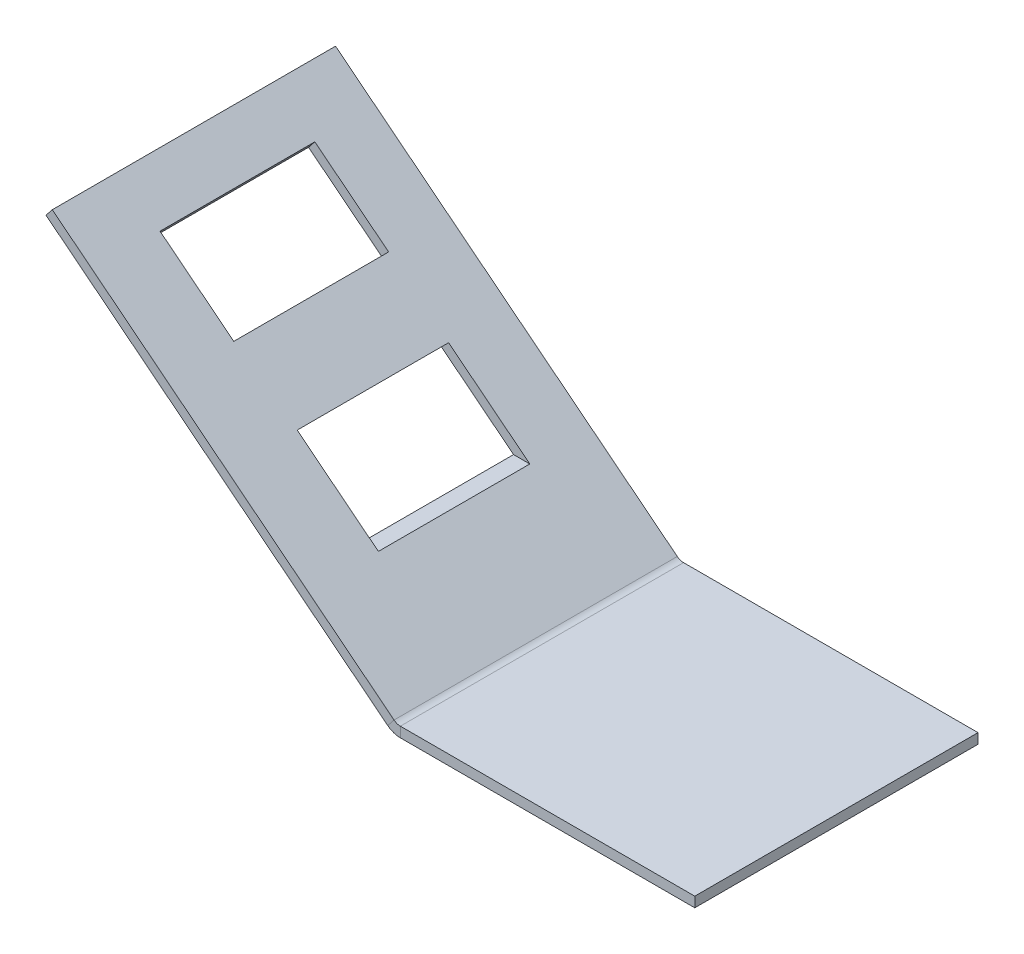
ISO-10303-21;
HEADER;
FILE_DESCRIPTION(('STEP AP214'),'2;1');
FILE_NAME('part.step','',(''),(''),'','','');
FILE_SCHEMA(('AUTOMOTIVE_DESIGN { 1 0 10303 214 1 1 1 1 }'));
ENDSEC;
DATA;
#1=APPLICATION_CONTEXT('core data for automotive mechanical design processes');
#2=APPLICATION_PROTOCOL_DEFINITION('international standard','automotive_design',2000,#1);
#3=PRODUCT_CONTEXT('',#1,'mechanical');
#4=PRODUCT('Part','Part','',(#3));
#5=PRODUCT_RELATED_PRODUCT_CATEGORY('part','',(#4));
#6=PRODUCT_DEFINITION_FORMATION('','',#4);
#7=PRODUCT_DEFINITION_CONTEXT('part definition',#1,'design');
#8=PRODUCT_DEFINITION('design','',#6,#7);
#9=PRODUCT_DEFINITION_SHAPE('','',#8);
#10=(LENGTH_UNIT() NAMED_UNIT(*) SI_UNIT(.MILLI.,.METRE.));
#11=(NAMED_UNIT(*) PLANE_ANGLE_UNIT() SI_UNIT($,.RADIAN.));
#12=(NAMED_UNIT(*) SI_UNIT($,.STERADIAN.) SOLID_ANGLE_UNIT());
#13=UNCERTAINTY_MEASURE_WITH_UNIT(LENGTH_MEASURE(1.E-05),#10,'distance_accuracy_value','');
#14=(GEOMETRIC_REPRESENTATION_CONTEXT(3) GLOBAL_UNCERTAINTY_ASSIGNED_CONTEXT((#13)) GLOBAL_UNIT_ASSIGNED_CONTEXT((#10,
#11,#12)) REPRESENTATION_CONTEXT('',''));
#15=CARTESIAN_POINT('',(0.,0.,0.));
#16=DIRECTION('',(0.,0.,1.));
#17=DIRECTION('',(1.,0.,0.));
#18=AXIS2_PLACEMENT_3D('',#15,#16,#17);
#19=CARTESIAN_POINT('',(-68.1183407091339,54.0258064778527,28.));
#20=DIRECTION('',(0.621401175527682,0.783492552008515,0.));
#21=DIRECTION('',(-0.783492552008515,0.621401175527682,0.));
#22=AXIS2_PLACEMENT_3D('',#19,#20,#21);
#23=PLANE('',#22);
#24=DIRECTION('',(0.783492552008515,-0.621401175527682,0.));
#25=VECTOR('',#24,1.);
#26=CARTESIAN_POINT('',(-68.1183407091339,54.0258064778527,14.1326879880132));
#27=LINE('',#26,#25);
#28=CARTESIAN_POINT('',(-33.5678578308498,26.6232349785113,14.1326879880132));
#29=VERTEX_POINT('',#28);
#30=CARTESIAN_POINT('',(-17.5094716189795,13.8870576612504,14.1326879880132));
#31=VERTEX_POINT('',#30);
#32=EDGE_CURVE('E156',#29,#31,#27,.T.);
#33=ORIENTED_EDGE('',*,*,#32,.F.);
#34=DIRECTION('',(0.,0.,1.));
#35=VECTOR('',#34,1.);
#36=CARTESIAN_POINT('',(-33.5678578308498,26.6232349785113,28.));
#37=LINE('',#36,#35);
#38=CARTESIAN_POINT('',(-33.5678578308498,26.6232349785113,-15.808500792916));
#39=VERTEX_POINT('',#38);
#40=EDGE_CURVE('E274',#39,#29,#37,.T.);
#41=ORIENTED_EDGE('',*,*,#40,.F.);
#42=DIRECTION('',(-0.783492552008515,0.621401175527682,0.));
#43=VECTOR('',#42,1.);
#44=CARTESIAN_POINT('',(-68.1183407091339,54.0258064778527,-15.808500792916));
#45=LINE('',#44,#43);
#46=CARTESIAN_POINT('',(-17.5094716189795,13.8870576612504,-15.808500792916));
#47=VERTEX_POINT('',#46);
#48=EDGE_CURVE('E276',#47,#39,#45,.T.);
#49=ORIENTED_EDGE('',*,*,#48,.F.);
#50=DIRECTION('',(0.,0.,-1.));
#51=VECTOR('',#50,1.);
#52=CARTESIAN_POINT('',(-17.5094716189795,13.8870576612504,28.));
#53=LINE('',#52,#51);
#54=EDGE_CURVE('E278',#31,#47,#53,.T.);
#55=ORIENTED_EDGE('',*,*,#54,.F.);
#56=EDGE_LOOP('',(#33,#41,#49,#55));
#57=FACE_BOUND('',#56,.T.);
#58=DIRECTION('',(0.783492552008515,-0.621401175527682,0.));
#59=VECTOR('',#58,1.);
#60=CARTESIAN_POINT('',(-68.1183407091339,54.0258064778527,-28.));
#61=LINE('',#60,#59);
#62=CARTESIAN_POINT('',(-68.1183407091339,54.0258064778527,-28.));
#63=VERTEX_POINT('',#62);
#64=CARTESIAN_POINT('',(-0.545966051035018,0.433014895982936,-28.));
#65=VERTEX_POINT('',#64);
#66=EDGE_CURVE('E226',#63,#65,#61,.T.);
#67=ORIENTED_EDGE('',*,*,#66,.F.);
#68=DIRECTION('',(0.,0.,-1.));
#69=VECTOR('',#68,1.);
#70=CARTESIAN_POINT('',(-68.1183407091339,54.0258064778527,28.));
#71=LINE('',#70,#69);
#72=CARTESIAN_POINT('',(-68.1183407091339,54.0258064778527,28.));
#73=VERTEX_POINT('',#72);
#74=EDGE_CURVE('E184',#73,#63,#71,.T.);
#75=ORIENTED_EDGE('',*,*,#74,.F.);
#76=DIRECTION('',(0.783492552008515,-0.621401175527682,0.));
#77=VECTOR('',#76,1.);
#78=CARTESIAN_POINT('',(-68.1183407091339,54.0258064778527,28.));
#79=LINE('',#78,#77);
#80=CARTESIAN_POINT('',(-0.545966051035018,0.433014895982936,28.));
#81=VERTEX_POINT('',#80);
#82=EDGE_CURVE('E203',#73,#81,#79,.T.);
#83=ORIENTED_EDGE('',*,*,#82,.T.);
#84=DIRECTION('',(0.,0.,-1.));
#85=VECTOR('',#84,1.);
#86=CARTESIAN_POINT('',(-0.545966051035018,0.433014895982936,28.));
#87=LINE('',#86,#85);
#88=EDGE_CURVE('E181',#81,#65,#87,.T.);
#89=ORIENTED_EDGE('',*,*,#88,.T.);
#90=EDGE_LOOP('',(#67,#75,#83,#89));
#91=FACE_BOUND('',#90,.T.);
#92=DIRECTION('',(-0.783492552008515,0.621401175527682,0.));
#93=VECTOR('',#92,1.);
#94=CARTESIAN_POINT('',(-68.1183407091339,54.0258064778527,-15.9202216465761));
#95=LINE('',#94,#93);
#96=CARTESIAN_POINT('',(-45.5412159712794,36.1195075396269,-15.9202216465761));
#97=VERTEX_POINT('',#96);
#98=CARTESIAN_POINT('',(-60.1254282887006,47.686492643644,-15.9202216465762));
#99=VERTEX_POINT('',#98);
#100=EDGE_CURVE('E252',#97,#99,#95,.T.);
#101=ORIENTED_EDGE('',*,*,#100,.F.);
#102=DIRECTION('',(0.,0.,-1.));
#103=VECTOR('',#102,1.);
#104=CARTESIAN_POINT('',(-45.5412159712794,36.1195075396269,28.));
#105=LINE('',#104,#103);
#106=CARTESIAN_POINT('',(-45.5412159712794,36.1195075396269,14.6912922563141));
#107=VERTEX_POINT('',#106);
#108=EDGE_CURVE('E259',#107,#97,#105,.T.);
#109=ORIENTED_EDGE('',*,*,#108,.F.);
#110=DIRECTION('',(0.783492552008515,-0.621401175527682,0.));
#111=VECTOR('',#110,1.);
#112=CARTESIAN_POINT('',(-68.1183407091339,54.0258064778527,14.6912922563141));
#113=LINE('',#112,#111);
#114=CARTESIAN_POINT('',(-60.1254282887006,47.686492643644,14.6912922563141));
#115=VERTEX_POINT('',#114);
#116=EDGE_CURVE('E261',#115,#107,#113,.T.);
#117=ORIENTED_EDGE('',*,*,#116,.F.);
#118=DIRECTION('',(0.,0.,1.));
#119=VECTOR('',#118,1.);
#120=CARTESIAN_POINT('',(-60.1254282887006,47.686492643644,28.));
#121=LINE('',#120,#119);
#122=EDGE_CURVE('E267',#99,#115,#121,.T.);
#123=ORIENTED_EDGE('',*,*,#122,.F.);
#124=EDGE_LOOP('',(#101,#109,#117,#123));
#125=FACE_BOUND('',#124,.T.);
#126=ADVANCED_FACE('F34',(#57,#91,#125),#23,.T.);
#127=CARTESIAN_POINT('',(-69.3611430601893,52.4588213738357,28.));
#128=DIRECTION('',(0.621401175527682,0.783492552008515,0.));
#129=DIRECTION('',(-0.783492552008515,0.621401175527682,0.));
#130=AXIS2_PLACEMENT_3D('',#127,#128,#129);
#131=PLANE('',#130);
#132=DIRECTION('',(0.,0.,1.));
#133=VECTOR('',#132,1.);
#134=CARTESIAN_POINT('',(-36.7863905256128,26.6232349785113,28.));
#135=LINE('',#134,#133);
#136=CARTESIAN_POINT('',(-36.7863905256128,26.6232349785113,-15.808500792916));
#137=VERTEX_POINT('',#136);
#138=CARTESIAN_POINT('',(-36.7863905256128,26.6232349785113,14.1326879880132));
#139=VERTEX_POINT('',#138);
#140=EDGE_CURVE('E42',#137,#139,#135,.T.);
#141=ORIENTED_EDGE('',*,*,#140,.T.);
#142=DIRECTION('',(0.783492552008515,-0.621401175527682,0.));
#143=VECTOR('',#142,1.);
#144=CARTESIAN_POINT('',(-69.3611430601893,52.4588213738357,14.1326879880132));
#145=LINE('',#144,#143);
#146=CARTESIAN_POINT('',(-20.7280043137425,13.8870576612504,14.1326879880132));
#147=VERTEX_POINT('',#146);
#148=EDGE_CURVE('E11',#139,#147,#145,.T.);
#149=ORIENTED_EDGE('',*,*,#148,.T.);
#150=DIRECTION('',(0.,0.,-1.));
#151=VECTOR('',#150,1.);
#152=CARTESIAN_POINT('',(-20.7280043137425,13.8870576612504,28.));
#153=LINE('',#152,#151);
#154=CARTESIAN_POINT('',(-20.7280043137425,13.8870576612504,-15.808500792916));
#155=VERTEX_POINT('',#154);
#156=EDGE_CURVE('E144',#147,#155,#153,.T.);
#157=ORIENTED_EDGE('',*,*,#156,.T.);
#158=DIRECTION('',(-0.783492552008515,0.621401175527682,0.));
#159=VECTOR('',#158,1.);
#160=CARTESIAN_POINT('',(-69.3611430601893,52.4588213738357,-15.808500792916));
#161=LINE('',#160,#159);
#162=EDGE_CURVE('E148',#155,#137,#161,.T.);
#163=ORIENTED_EDGE('',*,*,#162,.T.);
#164=EDGE_LOOP('',(#141,#149,#157,#163));
#165=FACE_BOUND('',#164,.T.);
#166=DIRECTION('',(0.783492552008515,-0.621401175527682,0.));
#167=VECTOR('',#166,1.);
#168=CARTESIAN_POINT('',(-69.3611430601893,52.4588213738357,-28.));
#169=LINE('',#168,#167);
#170=CARTESIAN_POINT('',(-69.3611430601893,52.4588213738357,-28.));
#171=VERTEX_POINT('',#170);
#172=CARTESIAN_POINT('',(-1.78876840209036,-1.13397020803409,-28.));
#173=VERTEX_POINT('',#172);
#174=EDGE_CURVE('E220',#171,#173,#169,.T.);
#175=ORIENTED_EDGE('',*,*,#174,.T.);
#176=DIRECTION('',(0.,0.,-1.));
#177=VECTOR('',#176,1.);
#178=CARTESIAN_POINT('',(-1.78876840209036,-1.13397020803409,28.));
#179=LINE('',#178,#177);
#180=CARTESIAN_POINT('',(-1.78876840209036,-1.13397020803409,28.));
#181=VERTEX_POINT('',#180);
#182=EDGE_CURVE('E188',#181,#173,#179,.T.);
#183=ORIENTED_EDGE('',*,*,#182,.F.);
#184=DIRECTION('',(0.783492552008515,-0.621401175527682,0.));
#185=VECTOR('',#184,1.);
#186=CARTESIAN_POINT('',(-69.3611430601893,52.4588213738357,28.));
#187=LINE('',#186,#185);
#188=CARTESIAN_POINT('',(-69.3611430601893,52.4588213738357,28.));
#189=VERTEX_POINT('',#188);
#190=EDGE_CURVE('E197',#189,#181,#187,.T.);
#191=ORIENTED_EDGE('',*,*,#190,.F.);
#192=DIRECTION('',(0.,0.,-1.));
#193=VECTOR('',#192,1.);
#194=CARTESIAN_POINT('',(-69.3611430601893,52.4588213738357,28.));
#195=LINE('',#194,#193);
#196=EDGE_CURVE('E186',#189,#171,#195,.T.);
#197=ORIENTED_EDGE('',*,*,#196,.T.);
#198=EDGE_LOOP('',(#175,#183,#191,#197));
#199=FACE_BOUND('',#198,.T.);
#200=DIRECTION('',(0.,0.,1.));
#201=VECTOR('',#200,1.);
#202=CARTESIAN_POINT('',(-46.7840183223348,34.5525224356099,28.));
#203=LINE('',#202,#201);
#204=CARTESIAN_POINT('',(-46.7840183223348,34.5525224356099,14.6912922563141));
#205=VERTEX_POINT('',#204);
#206=CARTESIAN_POINT('',(-46.7840183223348,34.5525224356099,-15.9202216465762));
#207=VERTEX_POINT('',#206);
#208=EDGE_CURVE('E251',#205,#207,#203,.F.);
#209=ORIENTED_EDGE('',*,*,#208,.T.);
#210=DIRECTION('',(-0.783492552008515,0.621401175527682,0.));
#211=VECTOR('',#210,1.);
#212=CARTESIAN_POINT('',(-69.3611430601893,52.4588213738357,-15.9202216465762));
#213=LINE('',#212,#211);
#214=CARTESIAN_POINT('',(-61.3682306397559,46.1195075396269,-15.9202216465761));
#215=VERTEX_POINT('',#214);
#216=EDGE_CURVE('E247',#207,#215,#213,.T.);
#217=ORIENTED_EDGE('',*,*,#216,.T.);
#218=DIRECTION('',(0.,0.,1.));
#219=VECTOR('',#218,1.);
#220=CARTESIAN_POINT('',(-61.3682306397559,46.1195075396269,28.));
#221=LINE('',#220,#219);
#222=CARTESIAN_POINT('',(-61.3682306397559,46.1195075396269,14.6912922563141));
#223=VERTEX_POINT('',#222);
#224=EDGE_CURVE('E270',#215,#223,#221,.T.);
#225=ORIENTED_EDGE('',*,*,#224,.T.);
#226=DIRECTION('',(-0.783492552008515,0.621401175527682,0.));
#227=VECTOR('',#226,1.);
#228=CARTESIAN_POINT('',(-69.3611430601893,52.4588213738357,14.6912922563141));
#229=LINE('',#228,#227);
#230=EDGE_CURVE('E248',#223,#205,#229,.F.);
#231=ORIENTED_EDGE('',*,*,#230,.T.);
#232=EDGE_LOOP('',(#209,#217,#225,#231));
#233=FACE_BOUND('',#232,.T.);
#234=ADVANCED_FACE('F160',(#165,#199,#233),#131,.F.);
#235=CARTESIAN_POINT('',(0.69683630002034,0.,28.));
#236=DIRECTION('',(0.,0.,1.));
#237=DIRECTION('',(1.,0.,0.));
#238=AXIS2_PLACEMENT_3D('',#235,#236,#237);
#239=PLANE('',#238);
#240=DIRECTION('',(0.,-1.,0.));
#241=VECTOR('',#240,1.);
#242=CARTESIAN_POINT('',(0.69683630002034,0.,28.));
#243=LINE('',#242,#241);
#244=CARTESIAN_POINT('',(0.69683630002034,0.,28.));
#245=VERTEX_POINT('',#244);
#246=CARTESIAN_POINT('',(0.69683630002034,-2.,28.));
#247=VERTEX_POINT('',#246);
#248=EDGE_CURVE('E149',#245,#247,#243,.T.);
#249=ORIENTED_EDGE('',*,*,#248,.F.);
#250=CARTESIAN_POINT('',(0.69683630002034,1.99999999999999,28.));
#251=DIRECTION('',(0.,0.,-1.));
#252=DIRECTION('',(-1.,0.,0.));
#253=AXIS2_PLACEMENT_3D('',#250,#251,#252);
#254=CIRCLE('',#253,2.);
#255=EDGE_CURVE('E206',#81,#245,#254,.F.);
#256=ORIENTED_EDGE('',*,*,#255,.F.);
#257=DIRECTION('',(0.621401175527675,0.78349255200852,0.));
#258=VECTOR('',#257,1.);
#259=CARTESIAN_POINT('',(-1.78876840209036,-1.13397020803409,28.));
#260=LINE('',#259,#258);
#261=EDGE_CURVE('E168',#181,#81,#260,.T.);
#262=ORIENTED_EDGE('',*,*,#261,.F.);
#263=CARTESIAN_POINT('',(0.69683630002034,1.99999999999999,28.));
#264=DIRECTION('',(0.,0.,1.));
#265=DIRECTION('',(1.,0.,0.));
#266=AXIS2_PLACEMENT_3D('',#263,#264,#265);
#267=CIRCLE('',#266,4.);
#268=EDGE_CURVE('E194',#181,#247,#267,.T.);
#269=ORIENTED_EDGE('',*,*,#268,.T.);
#270=EDGE_LOOP('',(#249,#256,#262,#269));
#271=FACE_BOUND('',#270,.T.);
#272=ADVANCED_FACE('F36',(#271),#239,.T.);
#273=CARTESIAN_POINT('',(-1.78876840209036,-1.13397020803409,28.));
#274=DIRECTION('',(0.,0.,1.));
#275=DIRECTION('',(1.,0.,0.));
#276=AXIS2_PLACEMENT_3D('',#273,#274,#275);
#277=PLANE('',#276);
#278=DIRECTION('',(1.,0.,0.));
#279=VECTOR('',#278,1.);
#280=CARTESIAN_POINT('',(0.,0.,28.));
#281=LINE('',#280,#279);
#282=CARTESIAN_POINT('',(58.9096385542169,0.,28.));
#283=VERTEX_POINT('',#282);
#284=EDGE_CURVE('E209',#245,#283,#281,.T.);
#285=ORIENTED_EDGE('',*,*,#284,.F.);
#286=ORIENTED_EDGE('',*,*,#248,.T.);
#287=DIRECTION('',(1.,0.,0.));
#288=VECTOR('',#287,1.);
#289=CARTESIAN_POINT('',(0.,-2.,28.));
#290=LINE('',#289,#288);
#291=CARTESIAN_POINT('',(58.9096385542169,-2.,28.));
#292=VERTEX_POINT('',#291);
#293=EDGE_CURVE('E215',#247,#292,#290,.T.);
#294=ORIENTED_EDGE('',*,*,#293,.T.);
#295=DIRECTION('',(0.,-1.,0.));
#296=VECTOR('',#295,1.);
#297=CARTESIAN_POINT('',(58.9096385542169,0.,28.));
#298=LINE('',#297,#296);
#299=EDGE_CURVE('E212',#283,#292,#298,.T.);
#300=ORIENTED_EDGE('',*,*,#299,.F.);
#301=EDGE_LOOP('',(#285,#286,#294,#300));
#302=FACE_BOUND('',#301,.T.);
#303=ADVANCED_FACE('F331',(#302),#277,.T.);
#304=CARTESIAN_POINT('',(-0.545966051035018,0.433014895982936,-28.));
#305=DIRECTION('',(0.,0.,-1.));
#306=DIRECTION('',(-1.,0.,0.));
#307=AXIS2_PLACEMENT_3D('',#304,#305,#306);
#308=PLANE('',#307);
#309=DIRECTION('',(-0.621401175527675,-0.78349255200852,0.));
#310=VECTOR('',#309,1.);
#311=CARTESIAN_POINT('',(-0.545966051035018,0.433014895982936,-28.));
#312=LINE('',#311,#310);
#313=EDGE_CURVE('E170',#65,#173,#312,.T.);
#314=ORIENTED_EDGE('',*,*,#313,.F.);
#315=CARTESIAN_POINT('',(0.69683630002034,1.99999999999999,-28.));
#316=DIRECTION('',(0.,0.,-1.));
#317=DIRECTION('',(-1.,0.,0.));
#318=AXIS2_PLACEMENT_3D('',#315,#316,#317);
#319=CIRCLE('',#318,2.);
#320=CARTESIAN_POINT('',(0.69683630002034,0.,-28.));
#321=VERTEX_POINT('',#320);
#322=EDGE_CURVE('E229',#65,#321,#319,.F.);
#323=ORIENTED_EDGE('',*,*,#322,.T.);
#324=DIRECTION('',(0.,1.,0.));
#325=VECTOR('',#324,1.);
#326=CARTESIAN_POINT('',(0.69683630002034,-2.,-28.));
#327=LINE('',#326,#325);
#328=CARTESIAN_POINT('',(0.69683630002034,-2.,-28.));
#329=VERTEX_POINT('',#328);
#330=EDGE_CURVE('E172',#329,#321,#327,.T.);
#331=ORIENTED_EDGE('',*,*,#330,.F.);
#332=CARTESIAN_POINT('',(0.69683630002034,1.99999999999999,-28.));
#333=DIRECTION('',(0.,0.,1.));
#334=DIRECTION('',(1.,0.,0.));
#335=AXIS2_PLACEMENT_3D('',#332,#333,#334);
#336=CIRCLE('',#335,4.);
#337=EDGE_CURVE('E217',#173,#329,#336,.T.);
#338=ORIENTED_EDGE('',*,*,#337,.F.);
#339=EDGE_LOOP('',(#314,#323,#331,#338));
#340=FACE_BOUND('',#339,.T.);
#341=ADVANCED_FACE('F328',(#340),#308,.T.);
#342=CARTESIAN_POINT('',(0.69683630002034,-2.,-28.));
#343=DIRECTION('',(0.,0.,-1.));
#344=DIRECTION('',(-1.,0.,0.));
#345=AXIS2_PLACEMENT_3D('',#342,#343,#344);
#346=PLANE('',#345);
#347=ORIENTED_EDGE('',*,*,#66,.T.);
#348=ORIENTED_EDGE('',*,*,#313,.T.);
#349=ORIENTED_EDGE('',*,*,#174,.F.);
#350=DIRECTION('',(0.621401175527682,0.783492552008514,0.));
#351=VECTOR('',#350,1.);
#352=CARTESIAN_POINT('',(-69.3611430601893,52.4588213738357,-28.));
#353=LINE('',#352,#351);
#354=EDGE_CURVE('E223',#171,#63,#353,.T.);
#355=ORIENTED_EDGE('',*,*,#354,.T.);
#356=EDGE_LOOP('',(#347,#348,#349,#355));
#357=FACE_BOUND('',#356,.T.);
#358=ADVANCED_FACE('F324',(#357),#346,.T.);
#359=CARTESIAN_POINT('',(0.,-2.,28.));
#360=DIRECTION('',(0.,1.,0.));
#361=DIRECTION('',(0.,0.,1.));
#362=AXIS2_PLACEMENT_3D('',#359,#360,#361);
#363=PLANE('',#362);
#364=DIRECTION('',(1.,0.,0.));
#365=VECTOR('',#364,1.);
#366=CARTESIAN_POINT('',(0.,-2.,-28.));
#367=LINE('',#366,#365);
#368=CARTESIAN_POINT('',(58.9096385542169,-2.,-28.));
#369=VERTEX_POINT('',#368);
#370=EDGE_CURVE('E238',#329,#369,#367,.T.);
#371=ORIENTED_EDGE('',*,*,#370,.T.);
#372=DIRECTION('',(0.,0.,-1.));
#373=VECTOR('',#372,1.);
#374=CARTESIAN_POINT('',(58.9096385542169,-2.,28.));
#375=LINE('',#374,#373);
#376=EDGE_CURVE('E174',#292,#369,#375,.T.);
#377=ORIENTED_EDGE('',*,*,#376,.F.);
#378=ORIENTED_EDGE('',*,*,#293,.F.);
#379=DIRECTION('',(0.,0.,-1.));
#380=VECTOR('',#379,1.);
#381=CARTESIAN_POINT('',(0.69683630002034,-2.,28.));
#382=LINE('',#381,#380);
#383=EDGE_CURVE('E191',#247,#329,#382,.T.);
#384=ORIENTED_EDGE('',*,*,#383,.T.);
#385=EDGE_LOOP('',(#371,#377,#378,#384));
#386=FACE_BOUND('',#385,.T.);
#387=ADVANCED_FACE('F320',(#386),#363,.F.);
#388=CARTESIAN_POINT('',(58.9096385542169,0.,28.));
#389=DIRECTION('',(1.,0.,0.));
#390=DIRECTION('',(0.,0.,-1.));
#391=AXIS2_PLACEMENT_3D('',#388,#389,#390);
#392=PLANE('',#391);
#393=DIRECTION('',(0.,-1.,0.));
#394=VECTOR('',#393,1.);
#395=CARTESIAN_POINT('',(58.9096385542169,0.,-28.));
#396=LINE('',#395,#394);
#397=CARTESIAN_POINT('',(58.9096385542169,0.,-28.));
#398=VERTEX_POINT('',#397);
#399=EDGE_CURVE('E235',#398,#369,#396,.T.);
#400=ORIENTED_EDGE('',*,*,#399,.F.);
#401=DIRECTION('',(0.,0.,-1.));
#402=VECTOR('',#401,1.);
#403=CARTESIAN_POINT('',(58.9096385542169,0.,28.));
#404=LINE('',#403,#402);
#405=EDGE_CURVE('E176',#283,#398,#404,.T.);
#406=ORIENTED_EDGE('',*,*,#405,.F.);
#407=ORIENTED_EDGE('',*,*,#299,.T.);
#408=ORIENTED_EDGE('',*,*,#376,.T.);
#409=EDGE_LOOP('',(#400,#406,#407,#408));
#410=FACE_BOUND('',#409,.T.);
#411=ADVANCED_FACE('F316',(#410),#392,.T.);
#412=CARTESIAN_POINT('',(0.,0.,28.));
#413=DIRECTION('',(0.,1.,0.));
#414=DIRECTION('',(0.,0.,1.));
#415=AXIS2_PLACEMENT_3D('',#412,#413,#414);
#416=PLANE('',#415);
#417=DIRECTION('',(1.,0.,0.));
#418=VECTOR('',#417,1.);
#419=CARTESIAN_POINT('',(0.,0.,-28.));
#420=LINE('',#419,#418);
#421=EDGE_CURVE('E232',#321,#398,#420,.T.);
#422=ORIENTED_EDGE('',*,*,#421,.F.);
#423=DIRECTION('',(0.,0.,-1.));
#424=VECTOR('',#423,1.);
#425=CARTESIAN_POINT('',(0.69683630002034,0.,28.));
#426=LINE('',#425,#424);
#427=EDGE_CURVE('E178',#245,#321,#426,.T.);
#428=ORIENTED_EDGE('',*,*,#427,.F.);
#429=ORIENTED_EDGE('',*,*,#284,.T.);
#430=ORIENTED_EDGE('',*,*,#405,.T.);
#431=EDGE_LOOP('',(#422,#428,#429,#430));
#432=FACE_BOUND('',#431,.T.);
#433=ADVANCED_FACE('F312',(#432),#416,.T.);
#434=CARTESIAN_POINT('',(0.69683630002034,1.99999999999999,28.));
#435=DIRECTION('',(0.,0.,-1.));
#436=DIRECTION('',(-1.,0.,0.));
#437=AXIS2_PLACEMENT_3D('',#434,#435,#436);
#438=CYLINDRICAL_SURFACE('',#437,2.);
#439=ORIENTED_EDGE('',*,*,#322,.F.);
#440=ORIENTED_EDGE('',*,*,#88,.F.);
#441=ORIENTED_EDGE('',*,*,#255,.T.);
#442=ORIENTED_EDGE('',*,*,#427,.T.);
#443=EDGE_LOOP('',(#439,#440,#441,#442));
#444=FACE_BOUND('',#443,.T.);
#445=ADVANCED_FACE('F309',(#444),#438,.F.);
#446=CARTESIAN_POINT('',(-69.3611430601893,52.4588213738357,28.));
#447=DIRECTION('',(-0.783492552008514,0.621401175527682,0.));
#448=DIRECTION('',(-0.621401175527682,-0.783492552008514,0.));
#449=AXIS2_PLACEMENT_3D('',#446,#447,#448);
#450=PLANE('',#449);
#451=ORIENTED_EDGE('',*,*,#354,.F.);
#452=ORIENTED_EDGE('',*,*,#196,.F.);
#453=DIRECTION('',(0.621401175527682,0.783492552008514,0.));
#454=VECTOR('',#453,1.);
#455=CARTESIAN_POINT('',(-69.3611430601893,52.4588213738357,28.));
#456=LINE('',#455,#454);
#457=EDGE_CURVE('E200',#189,#73,#456,.T.);
#458=ORIENTED_EDGE('',*,*,#457,.T.);
#459=ORIENTED_EDGE('',*,*,#74,.T.);
#460=EDGE_LOOP('',(#451,#452,#458,#459));
#461=FACE_BOUND('',#460,.T.);
#462=ADVANCED_FACE('F308',(#461),#450,.T.);
#463=CARTESIAN_POINT('',(0.69683630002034,1.99999999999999,28.));
#464=DIRECTION('',(0.,0.,-1.));
#465=DIRECTION('',(-1.,0.,0.));
#466=AXIS2_PLACEMENT_3D('',#463,#464,#465);
#467=CYLINDRICAL_SURFACE('',#466,4.);
#468=ORIENTED_EDGE('',*,*,#337,.T.);
#469=ORIENTED_EDGE('',*,*,#383,.F.);
#470=ORIENTED_EDGE('',*,*,#268,.F.);
#471=ORIENTED_EDGE('',*,*,#182,.T.);
#472=EDGE_LOOP('',(#468,#469,#470,#471));
#473=FACE_BOUND('',#472,.T.);
#474=ADVANCED_FACE('F362',(#473),#467,.T.);
#475=CARTESIAN_POINT('',(0.69683630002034,1.99999999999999,28.));
#476=DIRECTION('',(0.,0.,-1.));
#477=DIRECTION('',(-1.,0.,0.));
#478=AXIS2_PLACEMENT_3D('',#475,#476,#477);
#479=PLANE('',#478);
#480=ORIENTED_EDGE('',*,*,#190,.T.);
#481=ORIENTED_EDGE('',*,*,#261,.T.);
#482=ORIENTED_EDGE('',*,*,#82,.F.);
#483=ORIENTED_EDGE('',*,*,#457,.F.);
#484=EDGE_LOOP('',(#480,#481,#482,#483));
#485=FACE_BOUND('',#484,.T.);
#486=ADVANCED_FACE('F351',(#485),#479,.F.);
#487=CARTESIAN_POINT('',(0.69683630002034,1.99999999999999,-28.));
#488=DIRECTION('',(0.,0.,-1.));
#489=DIRECTION('',(-1.,0.,0.));
#490=AXIS2_PLACEMENT_3D('',#487,#488,#489);
#491=PLANE('',#490);
#492=ORIENTED_EDGE('',*,*,#370,.F.);
#493=ORIENTED_EDGE('',*,*,#330,.T.);
#494=ORIENTED_EDGE('',*,*,#421,.T.);
#495=ORIENTED_EDGE('',*,*,#399,.T.);
#496=EDGE_LOOP('',(#492,#493,#494,#495));
#497=FACE_BOUND('',#496,.T.);
#498=ADVANCED_FACE('F368',(#497),#491,.T.);
#499=CARTESIAN_POINT('',(-45.5412159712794,36.1195075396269,28.));
#500=DIRECTION('',(0.783492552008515,-0.621401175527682,0.));
#501=DIRECTION('',(0.,0.,-1.));
#502=AXIS2_PLACEMENT_3D('',#499,#500,#501);
#503=PLANE('',#502);
#504=DIRECTION('',(0.621401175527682,0.783492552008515,0.));
#505=VECTOR('',#504,1.);
#506=CARTESIAN_POINT('',(-45.5412159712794,36.1195075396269,14.6912922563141));
#507=LINE('',#506,#505);
#508=EDGE_CURVE('E241',#107,#205,#507,.F.);
#509=ORIENTED_EDGE('',*,*,#508,.F.);
#510=ORIENTED_EDGE('',*,*,#108,.T.);
#511=DIRECTION('',(0.621401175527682,0.783492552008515,0.));
#512=VECTOR('',#511,1.);
#513=CARTESIAN_POINT('',(-45.5412159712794,36.1195075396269,-15.9202216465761));
#514=LINE('',#513,#512);
#515=EDGE_CURVE('E244',#97,#207,#514,.F.);
#516=ORIENTED_EDGE('',*,*,#515,.T.);
#517=ORIENTED_EDGE('',*,*,#208,.F.);
#518=EDGE_LOOP('',(#509,#510,#516,#517));
#519=FACE_BOUND('',#518,.T.);
#520=ADVANCED_FACE('F370',(#519),#503,.F.);
#521=CARTESIAN_POINT('',(-68.1183407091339,54.0258064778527,-15.9202216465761));
#522=DIRECTION('',(0.,0.,-1.));
#523=DIRECTION('',(-0.783492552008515,0.621401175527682,0.));
#524=AXIS2_PLACEMENT_3D('',#521,#522,#523);
#525=PLANE('',#524);
#526=DIRECTION('',(-0.621401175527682,-0.783492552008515,0.));
#527=VECTOR('',#526,1.);
#528=CARTESIAN_POINT('',(-61.3682306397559,46.1195075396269,-15.9202216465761));
#529=LINE('',#528,#527);
#530=EDGE_CURVE('E263',#215,#99,#529,.F.);
#531=ORIENTED_EDGE('',*,*,#530,.F.);
#532=ORIENTED_EDGE('',*,*,#216,.F.);
#533=ORIENTED_EDGE('',*,*,#515,.F.);
#534=ORIENTED_EDGE('',*,*,#100,.T.);
#535=EDGE_LOOP('',(#531,#532,#533,#534));
#536=FACE_BOUND('',#535,.T.);
#537=ADVANCED_FACE('F376',(#536),#525,.F.);
#538=CARTESIAN_POINT('',(-68.1183407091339,54.0258064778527,14.6912922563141));
#539=DIRECTION('',(0.,0.,1.));
#540=DIRECTION('',(0.783492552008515,-0.621401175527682,0.));
#541=AXIS2_PLACEMENT_3D('',#538,#539,#540);
#542=PLANE('',#541);
#543=ORIENTED_EDGE('',*,*,#230,.F.);
#544=DIRECTION('',(-0.621401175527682,-0.783492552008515,0.));
#545=VECTOR('',#544,1.);
#546=CARTESIAN_POINT('',(-61.3682306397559,46.1195075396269,14.6912922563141));
#547=LINE('',#546,#545);
#548=EDGE_CURVE('E264',#223,#115,#547,.F.);
#549=ORIENTED_EDGE('',*,*,#548,.T.);
#550=ORIENTED_EDGE('',*,*,#116,.T.);
#551=ORIENTED_EDGE('',*,*,#508,.T.);
#552=EDGE_LOOP('',(#543,#549,#550,#551));
#553=FACE_BOUND('',#552,.T.);
#554=ADVANCED_FACE('F381',(#553),#542,.F.);
#555=CARTESIAN_POINT('',(-61.3682306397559,46.1195075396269,28.));
#556=DIRECTION('',(-0.783492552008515,0.621401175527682,0.));
#557=DIRECTION('',(0.,0.,1.));
#558=AXIS2_PLACEMENT_3D('',#555,#556,#557);
#559=PLANE('',#558);
#560=ORIENTED_EDGE('',*,*,#224,.F.);
#561=ORIENTED_EDGE('',*,*,#530,.T.);
#562=ORIENTED_EDGE('',*,*,#122,.T.);
#563=ORIENTED_EDGE('',*,*,#548,.F.);
#564=EDGE_LOOP('',(#560,#561,#562,#563));
#565=FACE_BOUND('',#564,.T.);
#566=ADVANCED_FACE('F298',(#565),#559,.F.);
#567=CARTESIAN_POINT('',(-69.3611430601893,26.6232349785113,14.1326879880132));
#568=DIRECTION('',(0.,0.,1.));
#569=DIRECTION('',(1.,0.,0.));
#570=AXIS2_PLACEMENT_3D('',#567,#568,#569);
#571=PLANE('',#570);
#572=ORIENTED_EDGE('',*,*,#32,.T.);
#573=DIRECTION('',(1.,0.,0.));
#574=VECTOR('',#573,1.);
#575=CARTESIAN_POINT('',(-69.3611430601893,13.8870576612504,14.1326879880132));
#576=LINE('',#575,#574);
#577=EDGE_CURVE('E49',#147,#31,#576,.T.);
#578=ORIENTED_EDGE('',*,*,#577,.F.);
#579=ORIENTED_EDGE('',*,*,#148,.F.);
#580=DIRECTION('',(1.,0.,0.));
#581=VECTOR('',#580,1.);
#582=CARTESIAN_POINT('',(-69.3611430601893,26.6232349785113,14.1326879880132));
#583=LINE('',#582,#581);
#584=EDGE_CURVE('E279',#139,#29,#583,.T.);
#585=ORIENTED_EDGE('',*,*,#584,.T.);
#586=EDGE_LOOP('',(#572,#578,#579,#585));
#587=FACE_BOUND('',#586,.T.);
#588=ADVANCED_FACE('F152',(#587),#571,.F.);
#589=CARTESIAN_POINT('',(-69.3611430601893,26.6232349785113,14.1326879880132));
#590=DIRECTION('',(0.,1.,0.));
#591=DIRECTION('',(0.,0.,1.));
#592=AXIS2_PLACEMENT_3D('',#589,#590,#591);
#593=PLANE('',#592);
#594=ORIENTED_EDGE('',*,*,#40,.T.);
#595=ORIENTED_EDGE('',*,*,#584,.F.);
#596=ORIENTED_EDGE('',*,*,#140,.F.);
#597=DIRECTION('',(1.,0.,0.));
#598=VECTOR('',#597,1.);
#599=CARTESIAN_POINT('',(-69.3611430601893,26.6232349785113,-15.808500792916));
#600=LINE('',#599,#598);
#601=EDGE_CURVE('E282',#137,#39,#600,.T.);
#602=ORIENTED_EDGE('',*,*,#601,.T.);
#603=EDGE_LOOP('',(#594,#595,#596,#602));
#604=FACE_BOUND('',#603,.T.);
#605=ADVANCED_FACE('F290',(#604),#593,.F.);
#606=CARTESIAN_POINT('',(-69.3611430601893,26.6232349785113,-15.808500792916));
#607=DIRECTION('',(0.,0.,-1.));
#608=DIRECTION('',(-1.,0.,0.));
#609=AXIS2_PLACEMENT_3D('',#606,#607,#608);
#610=PLANE('',#609);
#611=ORIENTED_EDGE('',*,*,#48,.T.);
#612=ORIENTED_EDGE('',*,*,#601,.F.);
#613=ORIENTED_EDGE('',*,*,#162,.F.);
#614=DIRECTION('',(1.,0.,0.));
#615=VECTOR('',#614,1.);
#616=CARTESIAN_POINT('',(-69.3611430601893,13.8870576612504,-15.808500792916));
#617=LINE('',#616,#615);
#618=EDGE_CURVE('E54',#155,#47,#617,.T.);
#619=ORIENTED_EDGE('',*,*,#618,.T.);
#620=EDGE_LOOP('',(#611,#612,#613,#619));
#621=FACE_BOUND('',#620,.T.);
#622=ADVANCED_FACE('F289',(#621),#610,.F.);
#623=CARTESIAN_POINT('',(-69.3611430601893,13.8870576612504,14.1326879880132));
#624=DIRECTION('',(0.,-1.,0.));
#625=DIRECTION('',(0.,0.,-1.));
#626=AXIS2_PLACEMENT_3D('',#623,#624,#625);
#627=PLANE('',#626);
#628=ORIENTED_EDGE('',*,*,#54,.T.);
#629=ORIENTED_EDGE('',*,*,#618,.F.);
#630=ORIENTED_EDGE('',*,*,#156,.F.);
#631=ORIENTED_EDGE('',*,*,#577,.T.);
#632=EDGE_LOOP('',(#628,#629,#630,#631));
#633=FACE_BOUND('',#632,.T.);
#634=ADVANCED_FACE('F145',(#633),#627,.F.);
#635=CLOSED_SHELL('',(#126,#234,#272,#303,#341,#358,#387,#411,#433,#445,#462,#474,#486,#498,
#520,#537,#554,#566,#588,#605,#622,#634));
#636=MANIFOLD_SOLID_BREP('B2',#635);
#637=ADVANCED_BREP_SHAPE_REPRESENTATION('',(#18,#636),#14);
#638=SHAPE_DEFINITION_REPRESENTATION(#9,#637);
ENDSEC;
END-ISO-10303-21;
